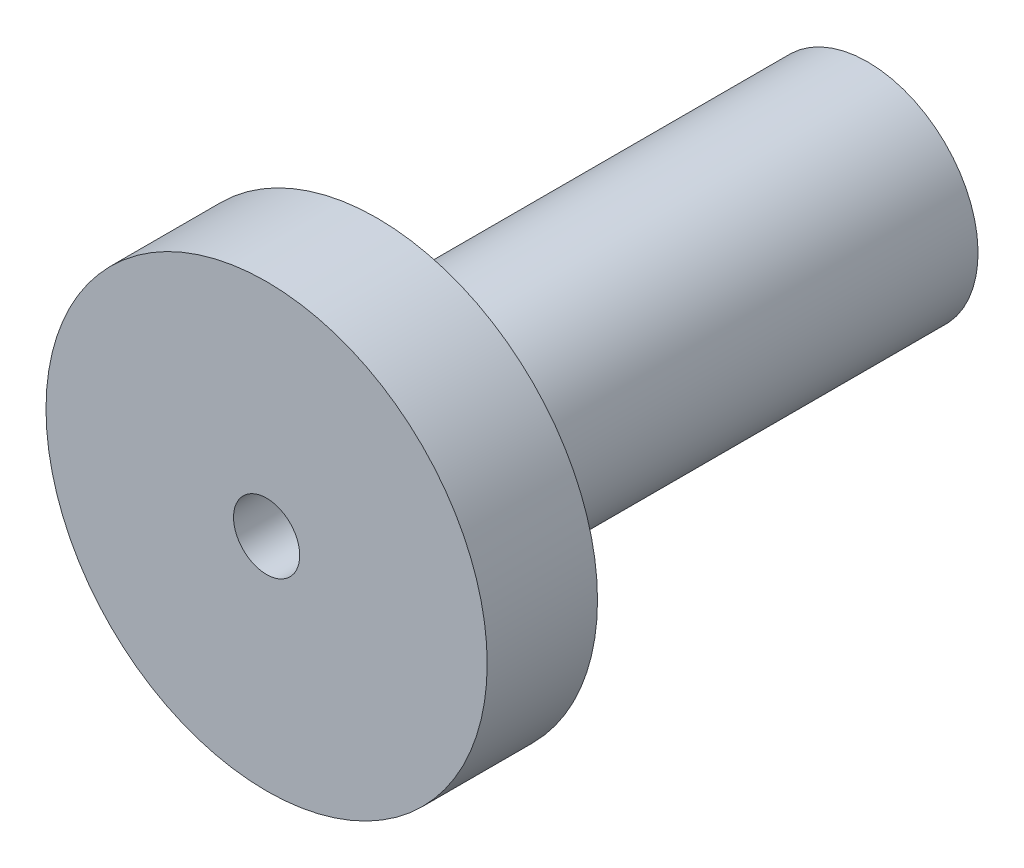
ISO-10303-21;
HEADER;
FILE_DESCRIPTION(('STEP AP214'),'2;1');
FILE_NAME('part.step','',(''),(''),'','','');
FILE_SCHEMA(('AUTOMOTIVE_DESIGN { 1 0 10303 214 1 1 1 1 }'));
ENDSEC;
DATA;
#1=APPLICATION_CONTEXT('core data for automotive mechanical design processes');
#2=APPLICATION_PROTOCOL_DEFINITION('international standard','automotive_design',2000,#1);
#3=PRODUCT_CONTEXT('',#1,'mechanical');
#4=PRODUCT('Part','Part','',(#3));
#5=PRODUCT_RELATED_PRODUCT_CATEGORY('part','',(#4));
#6=PRODUCT_DEFINITION_FORMATION('','',#4);
#7=PRODUCT_DEFINITION_CONTEXT('part definition',#1,'design');
#8=PRODUCT_DEFINITION('design','',#6,#7);
#9=PRODUCT_DEFINITION_SHAPE('','',#8);
#10=(LENGTH_UNIT() NAMED_UNIT(*) SI_UNIT(.MILLI.,.METRE.));
#11=(NAMED_UNIT(*) PLANE_ANGLE_UNIT() SI_UNIT($,.RADIAN.));
#12=(NAMED_UNIT(*) SI_UNIT($,.STERADIAN.) SOLID_ANGLE_UNIT());
#13=UNCERTAINTY_MEASURE_WITH_UNIT(LENGTH_MEASURE(1.E-05),#10,'distance_accuracy_value','');
#14=(GEOMETRIC_REPRESENTATION_CONTEXT(3) GLOBAL_UNCERTAINTY_ASSIGNED_CONTEXT((#13)) GLOBAL_UNIT_ASSIGNED_CONTEXT((#10,
#11,#12)) REPRESENTATION_CONTEXT('',''));
#15=CARTESIAN_POINT('',(0.,0.,0.));
#16=DIRECTION('',(0.,0.,1.));
#17=DIRECTION('',(1.,0.,0.));
#18=AXIS2_PLACEMENT_3D('',#15,#16,#17);
#19=CARTESIAN_POINT('',(0.,0.,-32.5));
#20=DIRECTION('',(0.,0.,1.));
#21=DIRECTION('',(0.,-1.,0.));
#22=AXIS2_PLACEMENT_3D('',#19,#20,#21);
#23=CYLINDRICAL_SURFACE('',#22,3.);
#24=CARTESIAN_POINT('',(0.,0.,10.));
#25=DIRECTION('',(0.,0.,1.));
#26=DIRECTION('',(0.,-1.,0.));
#27=AXIS2_PLACEMENT_3D('',#24,#25,#26);
#28=CIRCLE('',#27,3.);
#29=CARTESIAN_POINT('',(0.,-3.,10.));
#30=VERTEX_POINT('',#29);
#31=EDGE_CURVE('E22',#30,#30,#28,.T.);
#32=ORIENTED_EDGE('',*,*,#31,.T.);
#33=EDGE_LOOP('',(#32));
#34=FACE_BOUND('',#33,.T.);
#35=CARTESIAN_POINT('',(0.,0.,-32.5));
#36=DIRECTION('',(0.,0.,1.));
#37=DIRECTION('',(0.,-1.,0.));
#38=AXIS2_PLACEMENT_3D('',#35,#36,#37);
#39=CIRCLE('',#38,3.);
#40=CARTESIAN_POINT('',(0.,-3.,-32.5));
#41=VERTEX_POINT('',#40);
#42=EDGE_CURVE('E34',#41,#41,#39,.T.);
#43=ORIENTED_EDGE('',*,*,#42,.F.);
#44=EDGE_LOOP('',(#43));
#45=FACE_BOUND('',#44,.T.);
#46=ADVANCED_FACE('F12',(#34,#45),#23,.F.);
#47=CARTESIAN_POINT('',(0.,0.,7.));
#48=DIRECTION('',(0.,0.,-1.));
#49=DIRECTION('',(0.,1.,0.));
#50=AXIS2_PLACEMENT_3D('',#47,#48,#49);
#51=CYLINDRICAL_SURFACE('',#50,20.);
#52=CARTESIAN_POINT('',(0.,0.,10.));
#53=DIRECTION('',(0.,0.,1.));
#54=DIRECTION('',(0.,-1.,0.));
#55=AXIS2_PLACEMENT_3D('',#52,#53,#54);
#56=CIRCLE('',#55,20.);
#57=CARTESIAN_POINT('',(0.,-20.,10.));
#58=VERTEX_POINT('',#57);
#59=EDGE_CURVE('E18',#58,#58,#56,.T.);
#60=ORIENTED_EDGE('',*,*,#59,.F.);
#61=EDGE_LOOP('',(#60));
#62=FACE_BOUND('',#61,.T.);
#63=CARTESIAN_POINT('',(0.,0.,0.));
#64=DIRECTION('',(0.,0.,-1.));
#65=DIRECTION('',(0.,1.,0.));
#66=AXIS2_PLACEMENT_3D('',#63,#64,#65);
#67=CIRCLE('',#66,20.);
#68=CARTESIAN_POINT('',(0.,20.,0.));
#69=VERTEX_POINT('',#68);
#70=EDGE_CURVE('E26',#69,#69,#67,.T.);
#71=ORIENTED_EDGE('',*,*,#70,.F.);
#72=EDGE_LOOP('',(#71));
#73=FACE_BOUND('',#72,.T.);
#74=ADVANCED_FACE('F41',(#62,#73),#51,.T.);
#75=CARTESIAN_POINT('',(0.,0.,10.));
#76=DIRECTION('',(0.,0.,1.));
#77=DIRECTION('',(0.,-1.,0.));
#78=AXIS2_PLACEMENT_3D('',#75,#76,#77);
#79=PLANE('',#78);
#80=ORIENTED_EDGE('',*,*,#59,.T.);
#81=EDGE_LOOP('',(#80));
#82=FACE_BOUND('',#81,.T.);
#83=ORIENTED_EDGE('',*,*,#31,.F.);
#84=EDGE_LOOP('',(#83));
#85=FACE_BOUND('',#84,.T.);
#86=ADVANCED_FACE('F48',(#82,#85),#79,.T.);
#87=CARTESIAN_POINT('',(0.,0.,0.));
#88=DIRECTION('',(0.,0.,-1.));
#89=DIRECTION('',(0.,1.,0.));
#90=AXIS2_PLACEMENT_3D('',#87,#88,#89);
#91=PLANE('',#90);
#92=CARTESIAN_POINT('',(0.,0.,0.));
#93=DIRECTION('',(0.,0.,-1.));
#94=DIRECTION('',(0.,1.,0.));
#95=AXIS2_PLACEMENT_3D('',#92,#93,#94);
#96=CIRCLE('',#95,10.);
#97=CARTESIAN_POINT('',(0.,10.,0.));
#98=VERTEX_POINT('',#97);
#99=EDGE_CURVE('E8',#98,#98,#96,.T.);
#100=ORIENTED_EDGE('',*,*,#99,.F.);
#101=EDGE_LOOP('',(#100));
#102=FACE_BOUND('',#101,.T.);
#103=ORIENTED_EDGE('',*,*,#70,.T.);
#104=EDGE_LOOP('',(#103));
#105=FACE_BOUND('',#104,.T.);
#106=ADVANCED_FACE('F54',(#102,#105),#91,.T.);
#107=CARTESIAN_POINT('',(0.,0.,28.2842712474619));
#108=DIRECTION('',(0.,0.,-1.));
#109=DIRECTION('',(0.,1.,0.));
#110=AXIS2_PLACEMENT_3D('',#107,#108,#109);
#111=CYLINDRICAL_SURFACE('',#110,10.);
#112=ORIENTED_EDGE('',*,*,#99,.T.);
#113=EDGE_LOOP('',(#112));
#114=FACE_BOUND('',#113,.T.);
#115=CARTESIAN_POINT('',(0.,0.,-44.5));
#116=DIRECTION('',(0.,0.,-1.));
#117=DIRECTION('',(0.,1.,0.));
#118=AXIS2_PLACEMENT_3D('',#115,#116,#117);
#119=CIRCLE('',#118,10.);
#120=CARTESIAN_POINT('',(0.,10.,-44.5));
#121=VERTEX_POINT('',#120);
#122=EDGE_CURVE('E31',#121,#121,#119,.T.);
#123=ORIENTED_EDGE('',*,*,#122,.F.);
#124=EDGE_LOOP('',(#123));
#125=FACE_BOUND('',#124,.T.);
#126=ADVANCED_FACE('F60',(#114,#125),#111,.T.);
#127=CARTESIAN_POINT('',(0.,0.,-44.5));
#128=DIRECTION('',(0.,0.,-1.));
#129=DIRECTION('',(0.,1.,0.));
#130=AXIS2_PLACEMENT_3D('',#127,#128,#129);
#131=PLANE('',#130);
#132=ORIENTED_EDGE('',*,*,#122,.T.);
#133=EDGE_LOOP('',(#132));
#134=FACE_BOUND('',#133,.T.);
#135=ADVANCED_FACE('F64',(#134),#131,.T.);
#136=CARTESIAN_POINT('',(0.,0.,-32.5));
#137=DIRECTION('',(0.,0.,1.));
#138=DIRECTION('',(0.,-1.,0.));
#139=AXIS2_PLACEMENT_3D('',#136,#137,#138);
#140=PLANE('',#139);
#141=ORIENTED_EDGE('',*,*,#42,.T.);
#142=EDGE_LOOP('',(#141));
#143=FACE_BOUND('',#142,.T.);
#144=ADVANCED_FACE('F38',(#143),#140,.T.);
#145=CLOSED_SHELL('',(#46,#74,#86,#106,#126,#135,#144));
#146=MANIFOLD_SOLID_BREP('B1',#145);
#147=ADVANCED_BREP_SHAPE_REPRESENTATION('',(#18,#146),#14);
#148=SHAPE_DEFINITION_REPRESENTATION(#9,#147);
ENDSEC;
END-ISO-10303-21;
